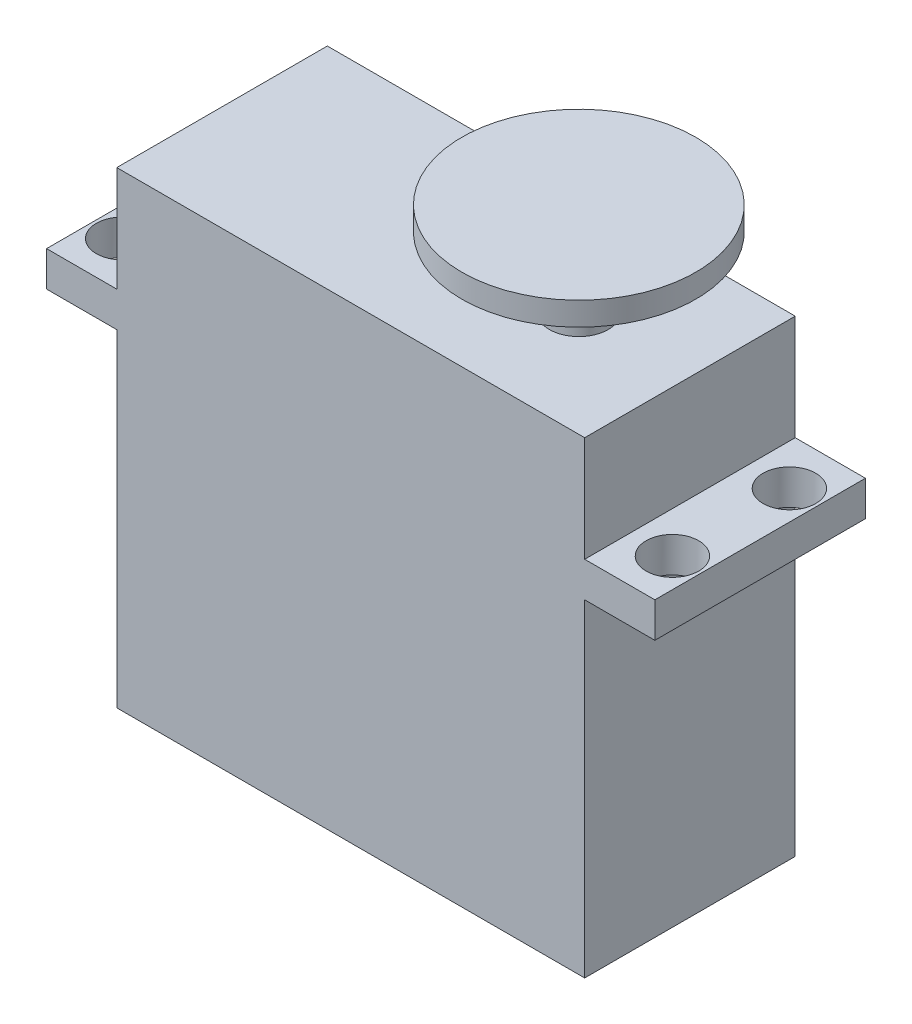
from build123d import *

# Parameters (mm, degrees)
SKETCH1_W           = 40
SKETCH1_H           = 18
BOSS_EXTRUDE1_DEPTH = 40
SKETCH2_W           = 6
SKETCH2_H           = 18
BOSS_EXTRUDE2_DEPTH = 3
SKETCH3_R           = 2.5
BOSS_EXTRUDE3_DEPTH = 6
SKETCH4_R           = 10
BOSS_EXTRUDE4_DEPTH = 2
CUT_EXTRUDE1_REACH  = 60.634
SKETCH5_R           = 2.25


with BuildPart() as part:
    # Sketch1 → Boss-Extrude1 (new body)
    with BuildSketch(Plane(origin=(0, 0, 0), x_dir=(1, 0, 0), z_dir=(0, 1, 0))):
        with Locations((20, 9)):
            Rectangle(SKETCH1_W, SKETCH1_H)
    extrude(amount=BOSS_EXTRUDE1_DEPTH)

    # Sketch2 → Boss-Extrude2 (add)
    with BuildSketch(Plane(origin=(0, 28, 0), x_dir=(-1, 0, 0), z_dir=(0, -1, 0))):
        with Locations((3, 9)):
            Rectangle(SKETCH2_W, SKETCH2_H)
        with Locations((-43, 9)):
            Rectangle(SKETCH2_W, SKETCH2_H)
    extrude(amount=-BOSS_EXTRUDE2_DEPTH)

    # Sketch3 → Boss-Extrude3 (add)
    with BuildSketch(Plane(origin=(0, 40, 0), x_dir=(1, 0, 0), z_dir=(0, 1, 0))):
        with Locations(Location((30.5, 9, 0), (0, 0, 90))):
            Circle(SKETCH3_R)
    extrude(amount=BOSS_EXTRUDE3_DEPTH)

    # Sketch4 → Boss-Extrude4 (add)
    with BuildSketch(Plane(origin=(0, 46, 0), x_dir=(1, 0, 0), z_dir=(0, 1, 0))):
        with Locations(Location((30.5, 9, 0), (0, 0, 270))):
            Circle(SKETCH4_R)
    extrude(amount=BOSS_EXTRUDE4_DEPTH)

    # Sketch5 → Cut-Extrude1 (cut, up to next)
    with BuildSketch(Plane(origin=(0, 31, 0), x_dir=(1, 0, 0), z_dir=(0, 1, 0)), mode=Mode.PRIVATE) as cut_extrude1_sk1:
        with Locations(Location((-3.5, 14, 0), (0, 0, 270))):
            Circle(SKETCH5_R)
    cut_extrude1_tool1 = extrude(cut_extrude1_sk1.sketch, amount=-CUT_EXTRUDE1_REACH, mode=Mode.PRIVATE) & part.part
    # Sketch5 → Cut-Extrude1 (cut, up to next)
    with BuildSketch(Plane(origin=(0, 31, 0), x_dir=(1, 0, 0), z_dir=(0, 1, 0)), mode=Mode.PRIVATE) as cut_extrude1_sk2:
        with Locations(Location((-3.5, 4, 0), (0, 0, 270))):
            Circle(SKETCH5_R)
    cut_extrude1_tool2 = extrude(cut_extrude1_sk2.sketch, amount=-CUT_EXTRUDE1_REACH, mode=Mode.PRIVATE) & part.part
    cut_extrude1_1 = cut_extrude1_tool1.solids().sort_by_distance((-3.5, 31, -14))[0]
    add(cut_extrude1_1, mode=Mode.SUBTRACT)
    cut_extrude1_2 = cut_extrude1_tool2.solids().sort_by_distance((-3.5, 31, -4))[0]
    add(cut_extrude1_2, mode=Mode.SUBTRACT)
    cut_extrude1 = cut_extrude1_1 + cut_extrude1_2  # Cut-Extrude1 as one shape, for the pattern or mirror that repeats it

    # Mirror1: Cut-Extrude1 across plane
    add(cut_extrude1.mirror(Plane.ZY.offset(-20)), mode=Mode.SUBTRACT)


solid = part.part
